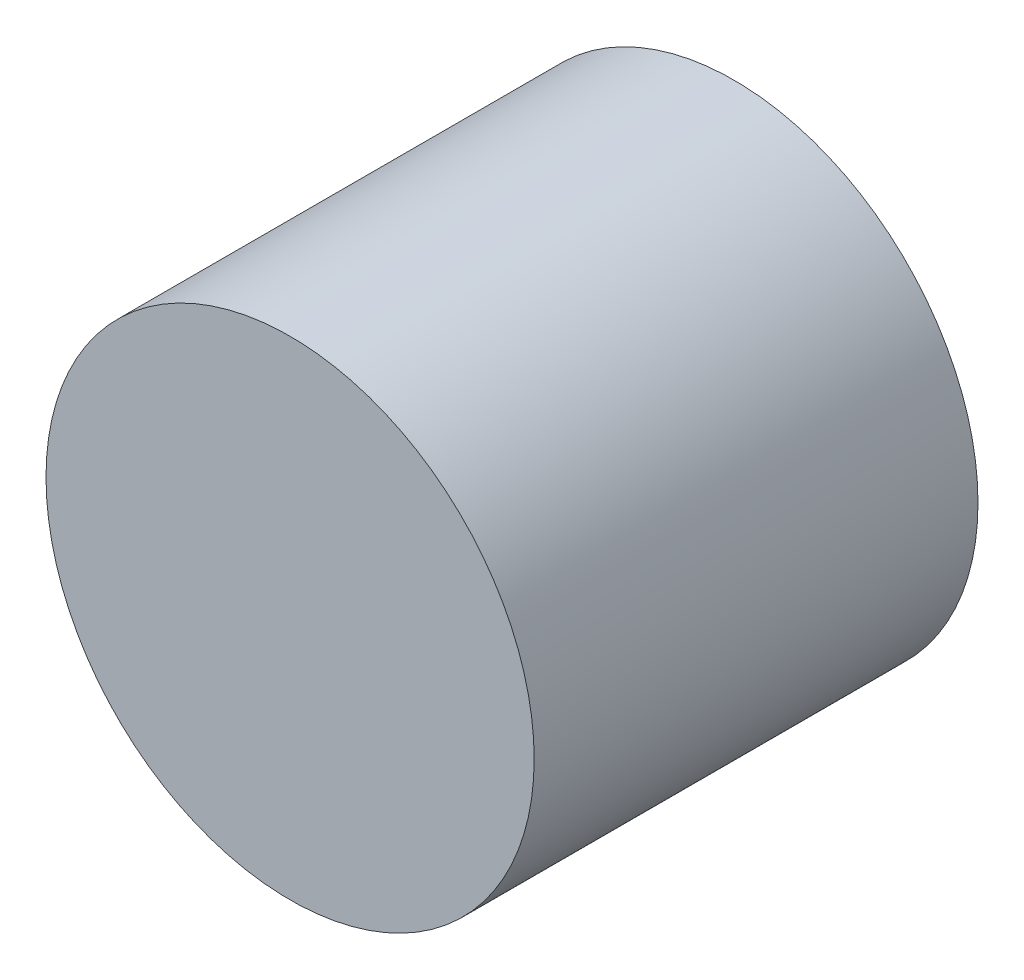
from build123d import *

# Parameters (mm, degrees)
BOSS_EXTRUDE1_DEPTH      = 1
BOSS_EXTRUDE1_DEPTH_BACK = 1
SKETCH1_R                = 1.1


with BuildPart() as part:
    # Sketch1 → Boss-Extrude1 (new, two sides: drawn at the far end of the back side and taken through both)
    with BuildSketch(Plane.XY.offset(-BOSS_EXTRUDE1_DEPTH_BACK)):
        Circle(SKETCH1_R)
    extrude(amount=BOSS_EXTRUDE1_DEPTH + BOSS_EXTRUDE1_DEPTH_BACK)


solid = part.part
